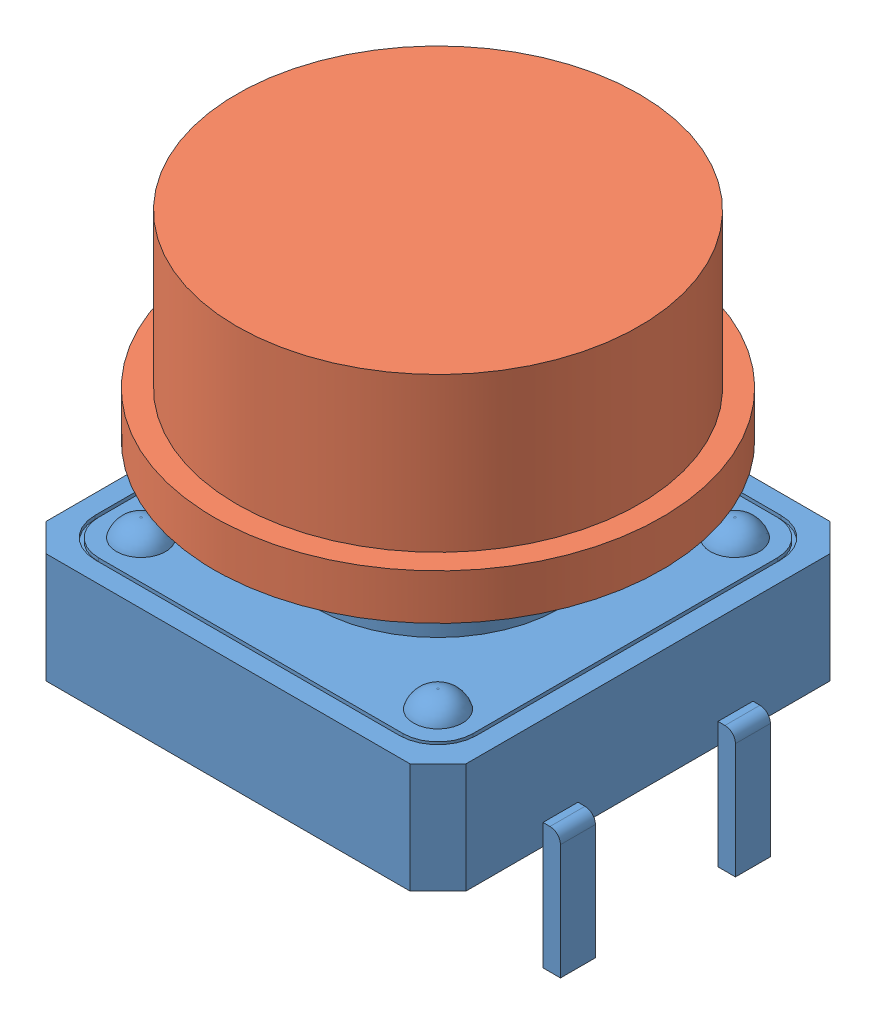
SolidWorks assembly Push Button with Cap.SLDASM, configuration По умолчанию (file format 8000). Lengths in mm.
Overall size (13 14.25 12.8).
2 component instances, 2 part files, 3 mates.
Components (placement in the parent):
- Tactile Push Button B3F-405 12X12x7.3mm-1: Tactile Push Button B3F-405 12X12x7.3mm.SLDPRT [По умолчанию] at (2.9403 -10.4023 13) size (13 10.05 12)
- Tactile Button Caps for B3F-4055 12X12X7.3MM-1: Tactile Button Caps for B3F-4055 12X12X7.3MM.SLDPRT [По умолчанию] at (2.9403 0.8477 13) x (-1 0 0) z (0 0 1) size (12.8 7.6 12.8)
Mates (geometry in assembly coordinates):
- Совпадение1: coincident: plane of Tactile Push Button B3F-405 12X12x7.3mm-1 through (1.0403 -3.3523 14.9) normal (0 0 1); plane of Tactile Button Caps for B3F-4055 12X12X7.3MM-1 through (3.8528 11.0165 14.9) normal (0 0 -1)
- Совпадение2: coincident: plane of Tactile Push Button B3F-405 12X12x7.3mm-1 through (4.8403 -3.3523 14.9) normal (1 0 0); plane of Tactile Button Caps for B3F-4055 12X12X7.3MM-1 through (4.8403 11.0165 14.9) normal (-1 0 0)
- Совпадение3: coincident anti-aligned: plane of Tactile Push Button B3F-405 12X12x7.3mm-1 through (2.9403 -6.7523 13) normal (0 1 0); plane of Tactile Button Caps for B3F-4055 12X12X7.3MM-1 through (2.9403 -6.7523 13) normal (0 -1 0)
